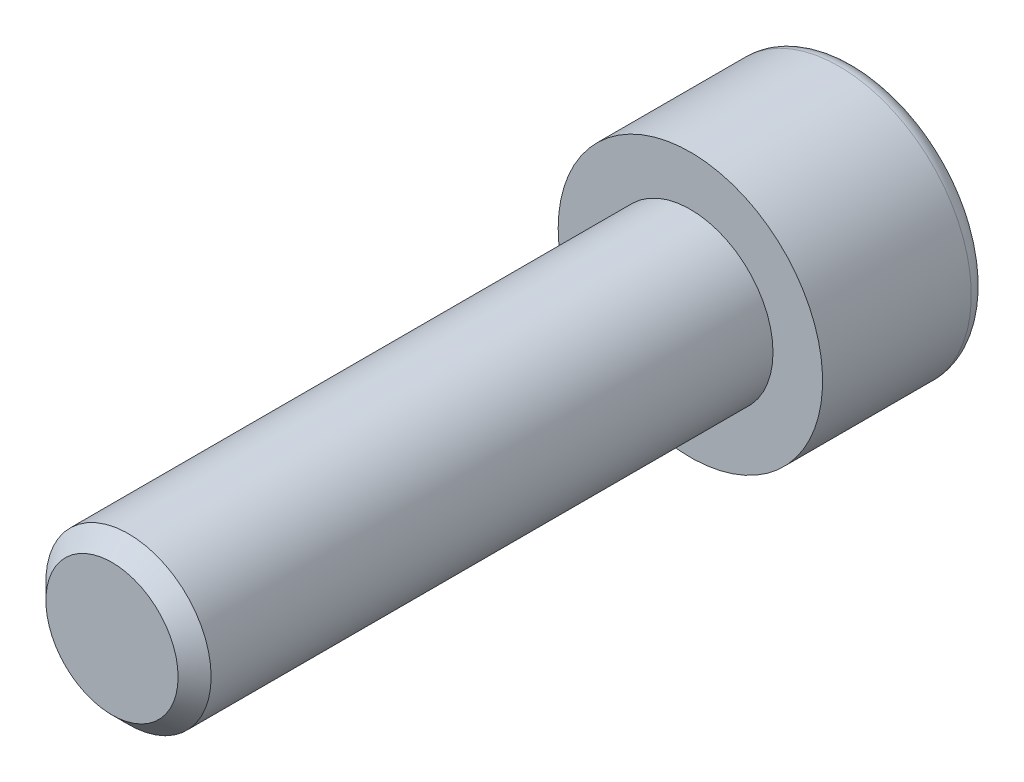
from build123d import *

# Parameters (mm, degrees)
ENLEV_MAT_EXTRU1_DEPTH = 5
ESQUISSE3_W            = 5
ESQUISSE3_H            = 35
CHANFREIN1_SIZE        = 1


with BuildPart() as part:
    # Esquisse1 → Base-R_volution (revolve)
    with BuildSketch(Plane(origin=(0, 0, 0), x_dir=(1, 0, 0), z_dir=(0, 1, 0)), mode=Mode.PRIVATE) as base_r_volution_sk:
        with BuildLine():
            Line((0, 0), (8, 0))
            Line((8, 0), (8, 9))
            ThreePointArc((8, 9), (7.707106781, 9.707106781), (7, 10))
            Line((7, 10), (0, 10))
            Line((0, 10), (0, 0))
        make_face()
    revolve(base_r_volution_sk.sketch.rotate(Axis((0, 0, 0), (0, 0, -1)), 180), axis=Axis((0, 0, 0), (0, 0, -1)))

    # Esquisse2 → enlev-mat-Extru1 (cut)
    with BuildSketch(Plane.XY.offset(-10)):
        Polygon((4, -2.309401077), (4, 2.309401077), (0, 4.618802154), (-4, 2.309401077), (-4, -2.309401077), (0, -4.618802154), align=None)
    extrude(amount=ENLEV_MAT_EXTRU1_DEPTH, mode=Mode.SUBTRACT)

    # Esquisse3 → Boss.-R_vol.1 (revolve)
    with BuildSketch(Plane(origin=(0, 0, 0), x_dir=(1, 0, 0), z_dir=(0, 1, 0))):
        with Locations((2.5, -17.5)):
            Rectangle(ESQUISSE3_W, ESQUISSE3_H)
    revolve(axis=Axis((0, 0, 0), (0, 0, 1)))

    # Chanfrein1
    chanfrein1_edges = [part.edges().sort_by_distance(p)[0] for p in [
        (-5, 0, 35),
    ]]
    chamfer(chanfrein1_edges, length=CHANFREIN1_SIZE)


solid = part.part
